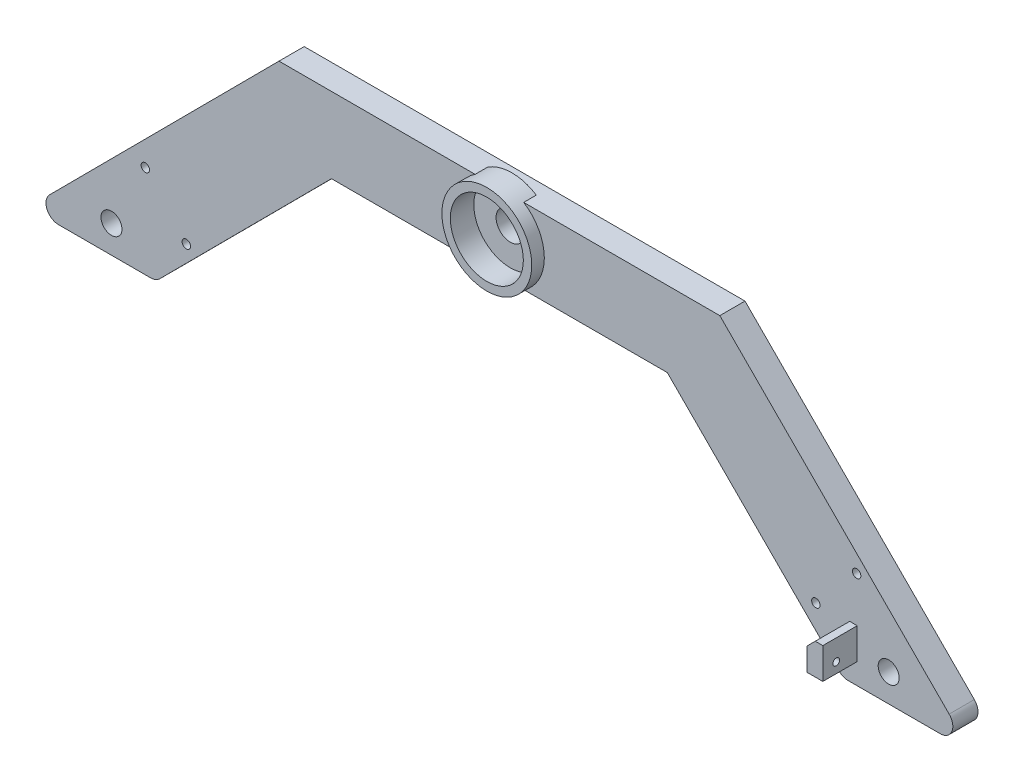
from build123d import *

# Parameters (mm, degrees)
BOSS_EXTRUDE1_DEPTH = 3.81
SKETCH2_R           = 3.175
CUT_EXTRUDE1_DEPTH  = 210.483232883
SKETCH3_R           = 13.589
BOSS_EXTRUDE2_DEPTH = 7.62
SKETCH4_R           = 4.318
CUT_EXTRUDE2_DEPTH  = 11.43
SKETCH5_R           = 11.049
CUT_EXTRUDE3_DEPTH  = 7.112
SKETCH8_W           = 4.826
SKETCH8_H           = 9.398
BOSS_EXTRUDE3_DEPTH = 10.414
CHAMFER1_SIZE       = 2.54
SKETCH9_R           = 1.0287
CUT_EXTRUDE4_DEPTH  = 258.507513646
FILLET1_R           = 0.508
SKETCH11_R          = 1.27
CUT_EXTRUDE5_DEPTH  = 10.16


with BuildPart() as part:
    # Sketch1 → Boss-Extrude1 (new, symmetric)
    with BuildSketch(Plane.XY):
        with BuildLine():
            Line((-78.422711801, -70.202411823), (-9.048093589, -0.500134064))
            Line((-9.048093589, -0.500134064), (124.303502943, -0.500134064))
            Line((124.303502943, -0.500134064), (193.678121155, -70.202411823))
            ThreePointArc((193.678121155, -70.202411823), (194.495965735, -74.352303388), (190.977704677, -76.700134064))
            Line((190.977704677, -76.700134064), (163.09108168, -76.700134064))
            ThreePointArc((163.09108168, -76.700134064), (161.628912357, -76.408395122), (160.390665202, -75.577856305))
            Line((160.390665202, -75.577856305), (108.427704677, -23.369472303))
            Line((108.427704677, -23.369472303), (6.827704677, -23.369472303))
            Line((6.827704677, -23.369472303), (-45.135255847, -75.577856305))
            ThreePointArc((-45.135255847, -75.577856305), (-46.373503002, -76.408395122), (-47.835672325, -76.700134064))
            Line((-47.835672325, -76.700134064), (-75.722295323, -76.700134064))
            ThreePointArc((-75.722295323, -76.700134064), (-79.24055638, -74.352303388), (-78.422711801, -70.202411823))
        make_face()
    extrude(amount=BOSS_EXTRUDE1_DEPTH, both=True)

    # Sketch2 → Cut-Extrude1 (cut, through all)
    with BuildSketch(Plane.XY.offset(3.81)):
        with Locations((-59.720295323, -68.318134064)):
            Circle(SKETCH2_R)
        with Locations((175.383820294, -68.318134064)):
            Circle(SKETCH2_R)
    extrude(amount=-CUT_EXTRUDE1_DEPTH, mode=Mode.SUBTRACT)

    # Sketch3 → Boss-Extrude2 (add)
    with BuildSketch(Plane.XY):
        with Locations(Location((57.627704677, -11.930134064, 0), (0, 0, 122.741263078))):
            Circle(SKETCH3_R)
    extrude(amount=BOSS_EXTRUDE2_DEPTH)

    # Sketch4 → Cut-Extrude2 (cut)
    with BuildSketch(Plane.XY.offset(7.62)):
        with Locations((57.627704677, -11.930134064)):
            Circle(SKETCH4_R)
    extrude(amount=-CUT_EXTRUDE2_DEPTH, mode=Mode.SUBTRACT)

    # Sketch5 → Cut-Extrude3 (cut)
    with BuildSketch(Plane.XY.offset(7.62)):
        with Locations((57.627704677, -11.930134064)):
            Circle(SKETCH5_R)
    extrude(amount=-CUT_EXTRUDE3_DEPTH, mode=Mode.SUBTRACT)

    # Sketch8 → Boss-Extrude3 (add)
    with BuildSketch(Plane.XY.offset(3.81)):
        with Locations((163.462297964, -65.651134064)):
            Rectangle(SKETCH8_W, SKETCH8_H)
    extrude(amount=BOSS_EXTRUDE3_DEPTH)

    # Chamfer1
    chamfer1_edges = [part.edges().sort_by_distance(p)[0] for p in [
        (161.049297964, -60.952134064, 9.017),
    ]]
    chamfer(chamfer1_edges, length=CHAMFER1_SIZE)

    # Sketch9 → Cut-Extrude4 (cut, through all)
    with BuildSketch(Plane(origin=(165.875297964, 0, 0), x_dir=(0, 0, -1), z_dir=(1, 0, 0))):
        with Locations((-10.165114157, -67.259916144)):
            Circle(SKETCH9_R)
    extrude(amount=-CUT_EXTRUDE4_DEPTH, mode=Mode.SUBTRACT)

    # Fillet1
    fillet1_edges = [part.edges().sort_by_distance(p)[0] for p in [
        (161.049297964, -67.259916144, 11.193814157),
    ]]
    fillet(fillet1_edges, radius=FILLET1_R)

    # Sketch11 → Cut-Extrude5 (cut)
    with BuildSketch(Plane(origin=(0, 0, -3.81), x_dir=(-1, 0, 0), z_dir=(0, 0, -1))):
        with Locations((37.07736093, -62.432546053)):
            Circle(SKETCH11_R)
        with Locations((49.486923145, -48.616373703)):
            Circle(SKETCH11_R)
        with Locations((-165.694397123, -47.369241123)):
            Circle(SKETCH11_R)
        with Locations((-153.351887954, -61.252783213)):
            Circle(SKETCH11_R)
    extrude(amount=-CUT_EXTRUDE5_DEPTH, mode=Mode.SUBTRACT)


solid = part.part
